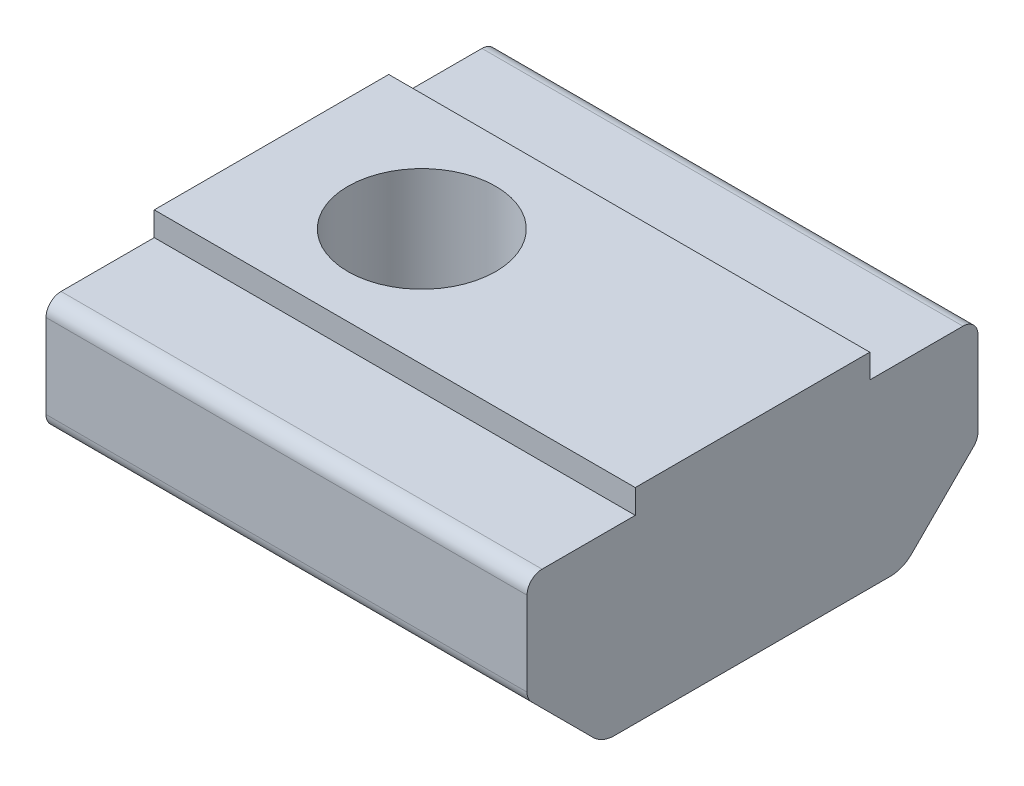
ISO-10303-21;
HEADER;
FILE_DESCRIPTION(('STEP AP214'),'2;1');
FILE_NAME('part.step','',(''),(''),'','','');
FILE_SCHEMA(('AUTOMOTIVE_DESIGN { 1 0 10303 214 1 1 1 1 }'));
ENDSEC;
DATA;
#1=APPLICATION_CONTEXT('core data for automotive mechanical design processes');
#2=APPLICATION_PROTOCOL_DEFINITION('international standard','automotive_design',2000,#1);
#3=PRODUCT_CONTEXT('',#1,'mechanical');
#4=PRODUCT('Part','Part','',(#3));
#5=PRODUCT_RELATED_PRODUCT_CATEGORY('part','',(#4));
#6=PRODUCT_DEFINITION_FORMATION('','',#4);
#7=PRODUCT_DEFINITION_CONTEXT('part definition',#1,'design');
#8=PRODUCT_DEFINITION('design','',#6,#7);
#9=PRODUCT_DEFINITION_SHAPE('','',#8);
#10=(LENGTH_UNIT() NAMED_UNIT(*) SI_UNIT(.MILLI.,.METRE.));
#11=(NAMED_UNIT(*) PLANE_ANGLE_UNIT() SI_UNIT($,.RADIAN.));
#12=(NAMED_UNIT(*) SI_UNIT($,.STERADIAN.) SOLID_ANGLE_UNIT());
#13=UNCERTAINTY_MEASURE_WITH_UNIT(LENGTH_MEASURE(1.E-05),#10,'distance_accuracy_value','');
#14=(GEOMETRIC_REPRESENTATION_CONTEXT(3) GLOBAL_UNCERTAINTY_ASSIGNED_CONTEXT((#13)) GLOBAL_UNIT_ASSIGNED_CONTEXT((#10,
#11,#12)) REPRESENTATION_CONTEXT('',''));
#15=CARTESIAN_POINT('',(0.,0.,0.));
#16=DIRECTION('',(0.,0.,1.));
#17=DIRECTION('',(1.,0.,0.));
#18=AXIS2_PLACEMENT_3D('',#15,#16,#17);
#19=CARTESIAN_POINT('',(7.,-6.6,0.));
#20=DIRECTION('',(0.,-1.,0.));
#21=DIRECTION('',(0.,0.,-1.));
#22=AXIS2_PLACEMENT_3D('',#19,#20,#21);
#23=PLANE('',#22);
#24=CARTESIAN_POINT('',(7.,-6.6,0.));
#25=DIRECTION('',(0.,1.,0.));
#26=DIRECTION('',(0.,0.,1.));
#27=AXIS2_PLACEMENT_3D('',#24,#25,#26);
#28=CIRCLE('',#27,2.35);
#29=CARTESIAN_POINT('',(7.,-6.6,2.35));
#30=VERTEX_POINT('',#29);
#31=EDGE_CURVE('E526',#30,#30,#28,.T.);
#32=ORIENTED_EDGE('',*,*,#31,.F.);
#33=EDGE_LOOP('',(#32));
#34=FACE_BOUND('',#33,.T.);
#35=CARTESIAN_POINT('',(7.,-6.6,0.));
#36=DIRECTION('',(0.,1.,0.));
#37=DIRECTION('',(0.,0.,1.));
#38=AXIS2_PLACEMENT_3D('',#35,#36,#37);
#39=CIRCLE('',#38,1.98997487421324);
#40=CARTESIAN_POINT('',(7.,-6.6,1.98997487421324));
#41=VERTEX_POINT('',#40);
#42=EDGE_CURVE('E528',#41,#41,#39,.T.);
#43=ORIENTED_EDGE('',*,*,#42,.T.);
#44=EDGE_LOOP('',(#43));
#45=FACE_BOUND('',#44,.T.);
#46=ADVANCED_FACE('F36',(#34,#45),#23,.T.);
#47=CARTESIAN_POINT('',(11.,-6.8,5.));
#48=DIRECTION('',(0.,1.,0.));
#49=DIRECTION('',(0.,0.,1.));
#50=AXIS2_PLACEMENT_3D('',#47,#48,#49);
#51=PLANE('',#50);
#52=CARTESIAN_POINT('',(0.,-6.8,0.));
#53=DIRECTION('',(0.,1.,0.));
#54=DIRECTION('',(0.,0.,1.));
#55=AXIS2_PLACEMENT_3D('',#52,#53,#54);
#56=CIRCLE('',#55,2.4585);
#57=CARTESIAN_POINT('',(0.,-6.8,2.4585));
#58=VERTEX_POINT('',#57);
#59=EDGE_CURVE('E533',#58,#58,#56,.T.);
#60=ORIENTED_EDGE('',*,*,#59,.T.);
#61=EDGE_LOOP('',(#60));
#62=FACE_BOUND('',#61,.T.);
#63=DIRECTION('',(0.,0.,-1.));
#64=VECTOR('',#63,1.);
#65=CARTESIAN_POINT('',(11.,-6.8,5.));
#66=LINE('',#65,#64);
#67=CARTESIAN_POINT('',(11.,-6.8,4.5857864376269));
#68=VERTEX_POINT('',#67);
#69=CARTESIAN_POINT('',(11.,-6.8,-4.58578643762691));
#70=VERTEX_POINT('',#69);
#71=EDGE_CURVE('E288',#68,#70,#66,.T.);
#72=ORIENTED_EDGE('',*,*,#71,.F.);
#73=DIRECTION('',(-1.,0.,0.));
#74=VECTOR('',#73,1.);
#75=CARTESIAN_POINT('',(11.,-6.8,4.5857864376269));
#76=LINE('',#75,#74);
#77=CARTESIAN_POINT('',(-5.,-6.8,4.5857864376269));
#78=VERTEX_POINT('',#77);
#79=EDGE_CURVE('E219',#68,#78,#76,.T.);
#80=ORIENTED_EDGE('',*,*,#79,.T.);
#81=DIRECTION('',(0.,0.,-1.));
#82=VECTOR('',#81,1.);
#83=CARTESIAN_POINT('',(-5.,-6.8,5.));
#84=LINE('',#83,#82);
#85=CARTESIAN_POINT('',(-5.,-6.8,-4.58578643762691));
#86=VERTEX_POINT('',#85);
#87=EDGE_CURVE('E192',#78,#86,#84,.T.);
#88=ORIENTED_EDGE('',*,*,#87,.T.);
#89=DIRECTION('',(-1.,0.,0.));
#90=VECTOR('',#89,1.);
#91=CARTESIAN_POINT('',(11.,-6.8,-4.58578643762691));
#92=LINE('',#91,#90);
#93=EDGE_CURVE('E171',#86,#70,#92,.F.);
#94=ORIENTED_EDGE('',*,*,#93,.T.);
#95=EDGE_LOOP('',(#72,#80,#88,#94));
#96=FACE_BOUND('',#95,.T.);
#97=CARTESIAN_POINT('',(7.,-6.8,0.));
#98=DIRECTION('',(0.,1.,0.));
#99=DIRECTION('',(0.,0.,1.));
#100=AXIS2_PLACEMENT_3D('',#97,#98,#99);
#101=CIRCLE('',#100,2.35);
#102=CARTESIAN_POINT('',(7.,-6.8,2.35));
#103=VERTEX_POINT('',#102);
#104=EDGE_CURVE('E190',#103,#103,#101,.T.);
#105=ORIENTED_EDGE('',*,*,#104,.T.);
#106=EDGE_LOOP('',(#105));
#107=FACE_BOUND('',#106,.T.);
#108=ADVANCED_FACE('F320',(#62,#96,#107),#51,.F.);
#109=CARTESIAN_POINT('',(11.,-0.8,7.5));
#110=DIRECTION('',(0.,0.,-1.));
#111=DIRECTION('',(-1.,0.,0.));
#112=AXIS2_PLACEMENT_3D('',#109,#110,#111);
#113=PLANE('',#112);
#114=DIRECTION('',(0.,-1.,0.));
#115=VECTOR('',#114,1.);
#116=CARTESIAN_POINT('',(11.,-0.8,7.5));
#117=LINE('',#116,#115);
#118=CARTESIAN_POINT('',(11.,-1.3,7.5));
#119=VERTEX_POINT('',#118);
#120=CARTESIAN_POINT('',(11.,-4.09289321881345,7.5));
#121=VERTEX_POINT('',#120);
#122=EDGE_CURVE('E211',#119,#121,#117,.T.);
#123=ORIENTED_EDGE('',*,*,#122,.F.);
#124=DIRECTION('',(-1.,0.,0.));
#125=VECTOR('',#124,1.);
#126=CARTESIAN_POINT('',(11.,-1.3,7.5));
#127=LINE('',#126,#125);
#128=CARTESIAN_POINT('',(-5.,-1.3,7.5));
#129=VERTEX_POINT('',#128);
#130=EDGE_CURVE('E261',#119,#129,#127,.T.);
#131=ORIENTED_EDGE('',*,*,#130,.T.);
#132=DIRECTION('',(0.,-1.,0.));
#133=VECTOR('',#132,1.);
#134=CARTESIAN_POINT('',(-5.,-0.8,7.5));
#135=LINE('',#134,#133);
#136=CARTESIAN_POINT('',(-5.,-4.09289321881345,7.5));
#137=VERTEX_POINT('',#136);
#138=EDGE_CURVE('E187',#129,#137,#135,.T.);
#139=ORIENTED_EDGE('',*,*,#138,.T.);
#140=DIRECTION('',(-1.,0.,0.));
#141=VECTOR('',#140,1.);
#142=CARTESIAN_POINT('',(11.,-4.09289321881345,7.5));
#143=LINE('',#142,#141);
#144=EDGE_CURVE('E51',#137,#121,#143,.F.);
#145=ORIENTED_EDGE('',*,*,#144,.T.);
#146=EDGE_LOOP('',(#123,#131,#139,#145));
#147=FACE_BOUND('',#146,.T.);
#148=ADVANCED_FACE('F274',(#147),#113,.F.);
#149=CARTESIAN_POINT('',(11.,-4.3,7.5));
#150=DIRECTION('',(0.,0.707106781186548,-0.707106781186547));
#151=DIRECTION('',(0.,0.707106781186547,0.707106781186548));
#152=AXIS2_PLACEMENT_3D('',#149,#150,#151);
#153=PLANE('',#152);
#154=DIRECTION('',(0.,-0.707106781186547,-0.707106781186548));
#155=VECTOR('',#154,1.);
#156=CARTESIAN_POINT('',(11.,-4.3,7.5));
#157=LINE('',#156,#155);
#158=CARTESIAN_POINT('',(11.,-4.44644660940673,7.35355339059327));
#159=VERTEX_POINT('',#158);
#160=CARTESIAN_POINT('',(11.,-6.50710678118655,5.29289321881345));
#161=VERTEX_POINT('',#160);
#162=EDGE_CURVE('E285',#159,#161,#157,.T.);
#163=ORIENTED_EDGE('',*,*,#162,.F.);
#164=DIRECTION('',(-1.,0.,0.));
#165=VECTOR('',#164,1.);
#166=CARTESIAN_POINT('',(11.,-4.44644660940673,7.35355339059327));
#167=LINE('',#166,#165);
#168=CARTESIAN_POINT('',(-5.,-4.44644660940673,7.35355339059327));
#169=VERTEX_POINT('',#168);
#170=EDGE_CURVE('E11',#159,#169,#167,.T.);
#171=ORIENTED_EDGE('',*,*,#170,.T.);
#172=DIRECTION('',(0.,-0.707106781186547,-0.707106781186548));
#173=VECTOR('',#172,1.);
#174=CARTESIAN_POINT('',(-5.,-4.3,7.5));
#175=LINE('',#174,#173);
#176=CARTESIAN_POINT('',(-5.,-6.50710678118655,5.29289321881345));
#177=VERTEX_POINT('',#176);
#178=EDGE_CURVE('E189',#169,#177,#175,.T.);
#179=ORIENTED_EDGE('',*,*,#178,.T.);
#180=DIRECTION('',(-1.,0.,0.));
#181=VECTOR('',#180,1.);
#182=CARTESIAN_POINT('',(11.,-6.50710678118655,5.29289321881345));
#183=LINE('',#182,#181);
#184=EDGE_CURVE('E227',#177,#161,#183,.F.);
#185=ORIENTED_EDGE('',*,*,#184,.T.);
#186=EDGE_LOOP('',(#163,#171,#179,#185));
#187=FACE_BOUND('',#186,.T.);
#188=ADVANCED_FACE('F284',(#187),#153,.F.);
#189=CARTESIAN_POINT('',(11.,-6.8,-5.));
#190=DIRECTION('',(0.,0.707106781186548,0.707106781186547));
#191=DIRECTION('',(0.,-0.707106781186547,0.707106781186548));
#192=AXIS2_PLACEMENT_3D('',#189,#190,#191);
#193=PLANE('',#192);
#194=DIRECTION('',(0.,0.707106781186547,-0.707106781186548));
#195=VECTOR('',#194,1.);
#196=CARTESIAN_POINT('',(-5.,-6.8,-5.));
#197=LINE('',#196,#195);
#198=CARTESIAN_POINT('',(-5.,-6.50710678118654,-5.29289321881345));
#199=VERTEX_POINT('',#198);
#200=CARTESIAN_POINT('',(-5.,-4.44644660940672,-7.35355339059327));
#201=VERTEX_POINT('',#200);
#202=EDGE_CURVE('E195',#199,#201,#197,.T.);
#203=ORIENTED_EDGE('',*,*,#202,.T.);
#204=DIRECTION('',(-1.,0.,0.));
#205=VECTOR('',#204,1.);
#206=CARTESIAN_POINT('',(11.,-4.44644660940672,-7.35355339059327));
#207=LINE('',#206,#205);
#208=CARTESIAN_POINT('',(11.,-4.44644660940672,-7.35355339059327));
#209=VERTEX_POINT('',#208);
#210=EDGE_CURVE('E250',#201,#209,#207,.F.);
#211=ORIENTED_EDGE('',*,*,#210,.T.);
#212=DIRECTION('',(0.,0.707106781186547,-0.707106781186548));
#213=VECTOR('',#212,1.);
#214=CARTESIAN_POINT('',(11.,-6.8,-5.));
#215=LINE('',#214,#213);
#216=CARTESIAN_POINT('',(11.,-6.50710678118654,-5.29289321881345));
#217=VERTEX_POINT('',#216);
#218=EDGE_CURVE('E291',#217,#209,#215,.T.);
#219=ORIENTED_EDGE('',*,*,#218,.F.);
#220=DIRECTION('',(-1.,0.,0.));
#221=VECTOR('',#220,1.);
#222=CARTESIAN_POINT('',(11.,-6.50710678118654,-5.29289321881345));
#223=LINE('',#222,#221);
#224=EDGE_CURVE('E234',#217,#199,#223,.T.);
#225=ORIENTED_EDGE('',*,*,#224,.T.);
#226=EDGE_LOOP('',(#203,#211,#219,#225));
#227=FACE_BOUND('',#226,.T.);
#228=ADVANCED_FACE('F428',(#227),#193,.F.);
#229=CARTESIAN_POINT('',(11.,-4.3,-7.5));
#230=DIRECTION('',(0.,0.,1.));
#231=DIRECTION('',(0.,-1.,0.));
#232=AXIS2_PLACEMENT_3D('',#229,#230,#231);
#233=PLANE('',#232);
#234=DIRECTION('',(0.,1.,0.));
#235=VECTOR('',#234,1.);
#236=CARTESIAN_POINT('',(11.,-4.3,-7.5));
#237=LINE('',#236,#235);
#238=CARTESIAN_POINT('',(11.,-4.09289321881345,-7.5));
#239=VERTEX_POINT('',#238);
#240=CARTESIAN_POINT('',(11.,-1.3,-7.5));
#241=VERTEX_POINT('',#240);
#242=EDGE_CURVE('E162',#239,#241,#237,.T.);
#243=ORIENTED_EDGE('',*,*,#242,.F.);
#244=DIRECTION('',(-1.,0.,0.));
#245=VECTOR('',#244,1.);
#246=CARTESIAN_POINT('',(11.,-4.09289321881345,-7.5));
#247=LINE('',#246,#245);
#248=CARTESIAN_POINT('',(-5.,-4.09289321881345,-7.5));
#249=VERTEX_POINT('',#248);
#250=EDGE_CURVE('E239',#239,#249,#247,.T.);
#251=ORIENTED_EDGE('',*,*,#250,.T.);
#252=DIRECTION('',(0.,1.,0.));
#253=VECTOR('',#252,1.);
#254=CARTESIAN_POINT('',(-5.,-4.3,-7.5));
#255=LINE('',#254,#253);
#256=CARTESIAN_POINT('',(-5.,-1.3,-7.5));
#257=VERTEX_POINT('',#256);
#258=EDGE_CURVE('E198',#249,#257,#255,.T.);
#259=ORIENTED_EDGE('',*,*,#258,.T.);
#260=DIRECTION('',(-1.,0.,0.));
#261=VECTOR('',#260,1.);
#262=CARTESIAN_POINT('',(11.,-1.3,-7.5));
#263=LINE('',#262,#261);
#264=EDGE_CURVE('E237',#257,#241,#263,.F.);
#265=ORIENTED_EDGE('',*,*,#264,.T.);
#266=EDGE_LOOP('',(#243,#251,#259,#265));
#267=FACE_BOUND('',#266,.T.);
#268=ADVANCED_FACE('F434',(#267),#233,.F.);
#269=CARTESIAN_POINT('',(11.,-0.799999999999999,-7.5));
#270=DIRECTION('',(0.,-1.,0.));
#271=DIRECTION('',(0.,0.,-1.));
#272=AXIS2_PLACEMENT_3D('',#269,#270,#271);
#273=PLANE('',#272);
#274=DIRECTION('',(0.,0.,1.));
#275=VECTOR('',#274,1.);
#276=CARTESIAN_POINT('',(11.,-0.799999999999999,-7.5));
#277=LINE('',#276,#275);
#278=CARTESIAN_POINT('',(11.,-0.799999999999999,-7.));
#279=VERTEX_POINT('',#278);
#280=CARTESIAN_POINT('',(11.,-0.799999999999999,-3.9));
#281=VERTEX_POINT('',#280);
#282=EDGE_CURVE('E149',#279,#281,#277,.T.);
#283=ORIENTED_EDGE('',*,*,#282,.F.);
#284=DIRECTION('',(-1.,0.,0.));
#285=VECTOR('',#284,1.);
#286=CARTESIAN_POINT('',(11.,-0.799999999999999,-7.));
#287=LINE('',#286,#285);
#288=CARTESIAN_POINT('',(-5.,-0.799999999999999,-7.));
#289=VERTEX_POINT('',#288);
#290=EDGE_CURVE('E258',#279,#289,#287,.T.);
#291=ORIENTED_EDGE('',*,*,#290,.T.);
#292=DIRECTION('',(0.,0.,1.));
#293=VECTOR('',#292,1.);
#294=CARTESIAN_POINT('',(-5.,-0.799999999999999,-7.5));
#295=LINE('',#294,#293);
#296=CARTESIAN_POINT('',(-5.,-0.799999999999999,-3.9));
#297=VERTEX_POINT('',#296);
#298=EDGE_CURVE('E168',#289,#297,#295,.T.);
#299=ORIENTED_EDGE('',*,*,#298,.T.);
#300=DIRECTION('',(-1.,0.,0.));
#301=VECTOR('',#300,1.);
#302=CARTESIAN_POINT('',(11.,-0.799999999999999,-3.9));
#303=LINE('',#302,#301);
#304=EDGE_CURVE('E165',#281,#297,#303,.T.);
#305=ORIENTED_EDGE('',*,*,#304,.F.);
#306=EDGE_LOOP('',(#283,#291,#299,#305));
#307=FACE_BOUND('',#306,.T.);
#308=ADVANCED_FACE('F166',(#307),#273,.F.);
#309=CARTESIAN_POINT('',(11.,-0.799999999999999,-3.9));
#310=DIRECTION('',(0.,0.,1.));
#311=DIRECTION('',(1.,0.,0.));
#312=AXIS2_PLACEMENT_3D('',#309,#310,#311);
#313=PLANE('',#312);
#314=DIRECTION('',(0.,1.,0.));
#315=VECTOR('',#314,1.);
#316=CARTESIAN_POINT('',(-5.,-0.799999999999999,-3.9));
#317=LINE('',#316,#315);
#318=CARTESIAN_POINT('',(-5.,0.,-3.9));
#319=VERTEX_POINT('',#318);
#320=EDGE_CURVE('E202',#297,#319,#317,.T.);
#321=ORIENTED_EDGE('',*,*,#320,.T.);
#322=DIRECTION('',(-1.,0.,0.));
#323=VECTOR('',#322,1.);
#324=CARTESIAN_POINT('',(11.,0.,-3.9));
#325=LINE('',#324,#323);
#326=CARTESIAN_POINT('',(11.,0.,-3.9));
#327=VERTEX_POINT('',#326);
#328=EDGE_CURVE('E172',#327,#319,#325,.T.);
#329=ORIENTED_EDGE('',*,*,#328,.F.);
#330=DIRECTION('',(0.,1.,0.));
#331=VECTOR('',#330,1.);
#332=CARTESIAN_POINT('',(11.,-0.799999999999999,-3.9));
#333=LINE('',#332,#331);
#334=EDGE_CURVE('E154',#281,#327,#333,.T.);
#335=ORIENTED_EDGE('',*,*,#334,.F.);
#336=ORIENTED_EDGE('',*,*,#304,.T.);
#337=EDGE_LOOP('',(#321,#329,#335,#336));
#338=FACE_BOUND('',#337,.T.);
#339=ADVANCED_FACE('F174',(#338),#313,.F.);
#340=CARTESIAN_POINT('',(11.,0.,-3.9));
#341=DIRECTION('',(0.,-1.,0.));
#342=DIRECTION('',(0.,0.,-1.));
#343=AXIS2_PLACEMENT_3D('',#340,#341,#342);
#344=PLANE('',#343);
#345=CARTESIAN_POINT('',(0.,0.,0.));
#346=DIRECTION('',(0.,1.,0.));
#347=DIRECTION('',(0.,0.,1.));
#348=AXIS2_PLACEMENT_3D('',#345,#346,#347);
#349=CIRCLE('',#348,2.4585);
#350=CARTESIAN_POINT('',(0.,0.,2.4585));
#351=VERTEX_POINT('',#350);
#352=EDGE_CURVE('E536',#351,#351,#349,.T.);
#353=ORIENTED_EDGE('',*,*,#352,.F.);
#354=EDGE_LOOP('',(#353));
#355=FACE_BOUND('',#354,.T.);
#356=DIRECTION('',(0.,0.,1.));
#357=VECTOR('',#356,1.);
#358=CARTESIAN_POINT('',(-5.,0.,-3.9));
#359=LINE('',#358,#357);
#360=CARTESIAN_POINT('',(-5.,0.,3.9));
#361=VERTEX_POINT('',#360);
#362=EDGE_CURVE('E204',#319,#361,#359,.T.);
#363=ORIENTED_EDGE('',*,*,#362,.T.);
#364=DIRECTION('',(-1.,0.,0.));
#365=VECTOR('',#364,1.);
#366=CARTESIAN_POINT('',(11.,0.,3.9));
#367=LINE('',#366,#365);
#368=CARTESIAN_POINT('',(11.,0.,3.9));
#369=VERTEX_POINT('',#368);
#370=EDGE_CURVE('E214',#369,#361,#367,.T.);
#371=ORIENTED_EDGE('',*,*,#370,.F.);
#372=DIRECTION('',(0.,0.,1.));
#373=VECTOR('',#372,1.);
#374=CARTESIAN_POINT('',(11.,0.,-3.9));
#375=LINE('',#374,#373);
#376=EDGE_CURVE('E177',#327,#369,#375,.T.);
#377=ORIENTED_EDGE('',*,*,#376,.F.);
#378=ORIENTED_EDGE('',*,*,#328,.T.);
#379=EDGE_LOOP('',(#363,#371,#377,#378));
#380=FACE_BOUND('',#379,.T.);
#381=ADVANCED_FACE('F306',(#355,#380),#344,.F.);
#382=CARTESIAN_POINT('',(11.,0.,3.9));
#383=DIRECTION('',(0.,0.,-1.));
#384=DIRECTION('',(0.,1.,0.));
#385=AXIS2_PLACEMENT_3D('',#382,#383,#384);
#386=PLANE('',#385);
#387=DIRECTION('',(0.,-1.,0.));
#388=VECTOR('',#387,1.);
#389=CARTESIAN_POINT('',(-5.,0.,3.9));
#390=LINE('',#389,#388);
#391=CARTESIAN_POINT('',(-5.,-0.8,3.9));
#392=VERTEX_POINT('',#391);
#393=EDGE_CURVE('E206',#361,#392,#390,.T.);
#394=ORIENTED_EDGE('',*,*,#393,.T.);
#395=DIRECTION('',(-1.,0.,0.));
#396=VECTOR('',#395,1.);
#397=CARTESIAN_POINT('',(11.,-0.8,3.9));
#398=LINE('',#397,#396);
#399=CARTESIAN_POINT('',(11.,-0.8,3.9));
#400=VERTEX_POINT('',#399);
#401=EDGE_CURVE('E186',#400,#392,#398,.T.);
#402=ORIENTED_EDGE('',*,*,#401,.F.);
#403=DIRECTION('',(0.,-1.,0.));
#404=VECTOR('',#403,1.);
#405=CARTESIAN_POINT('',(11.,0.,3.9));
#406=LINE('',#405,#404);
#407=EDGE_CURVE('E179',#369,#400,#406,.T.);
#408=ORIENTED_EDGE('',*,*,#407,.F.);
#409=ORIENTED_EDGE('',*,*,#370,.T.);
#410=EDGE_LOOP('',(#394,#402,#408,#409));
#411=FACE_BOUND('',#410,.T.);
#412=ADVANCED_FACE('F309',(#411),#386,.F.);
#413=CARTESIAN_POINT('',(11.,-0.8,3.9));
#414=DIRECTION('',(0.,-1.,0.));
#415=DIRECTION('',(0.,0.,-1.));
#416=AXIS2_PLACEMENT_3D('',#413,#414,#415);
#417=PLANE('',#416);
#418=DIRECTION('',(0.,0.,1.));
#419=VECTOR('',#418,1.);
#420=CARTESIAN_POINT('',(-5.,-0.8,3.9));
#421=LINE('',#420,#419);
#422=CARTESIAN_POINT('',(-5.,-0.8,7.));
#423=VERTEX_POINT('',#422);
#424=EDGE_CURVE('E208',#392,#423,#421,.T.);
#425=ORIENTED_EDGE('',*,*,#424,.T.);
#426=DIRECTION('',(-1.,0.,0.));
#427=VECTOR('',#426,1.);
#428=CARTESIAN_POINT('',(11.,-0.8,7.));
#429=LINE('',#428,#427);
#430=CARTESIAN_POINT('',(11.,-0.8,7.));
#431=VERTEX_POINT('',#430);
#432=EDGE_CURVE('E44',#423,#431,#429,.F.);
#433=ORIENTED_EDGE('',*,*,#432,.T.);
#434=DIRECTION('',(0.,0.,1.));
#435=VECTOR('',#434,1.);
#436=CARTESIAN_POINT('',(11.,-0.8,3.9));
#437=LINE('',#436,#435);
#438=EDGE_CURVE('E184',#400,#431,#437,.T.);
#439=ORIENTED_EDGE('',*,*,#438,.F.);
#440=ORIENTED_EDGE('',*,*,#401,.T.);
#441=EDGE_LOOP('',(#425,#433,#439,#440));
#442=FACE_BOUND('',#441,.T.);
#443=ADVANCED_FACE('F266',(#442),#417,.F.);
#444=CARTESIAN_POINT('',(11.,0.,0.));
#445=DIRECTION('',(1.,0.,0.));
#446=DIRECTION('',(0.,0.,-1.));
#447=AXIS2_PLACEMENT_3D('',#444,#445,#446);
#448=PLANE('',#447);
#449=ORIENTED_EDGE('',*,*,#218,.T.);
#450=CARTESIAN_POINT('',(11.,-4.09289321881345,-7.));
#451=DIRECTION('',(1.,0.,0.));
#452=DIRECTION('',(0.,0.,-1.));
#453=AXIS2_PLACEMENT_3D('',#450,#451,#452);
#454=CIRCLE('',#453,0.5);
#455=EDGE_CURVE('E256',#209,#239,#454,.T.);
#456=ORIENTED_EDGE('',*,*,#455,.T.);
#457=ORIENTED_EDGE('',*,*,#242,.T.);
#458=CARTESIAN_POINT('',(11.,-1.3,-7.));
#459=DIRECTION('',(1.,0.,0.));
#460=DIRECTION('',(0.,0.,-1.));
#461=AXIS2_PLACEMENT_3D('',#458,#459,#460);
#462=CIRCLE('',#461,0.5);
#463=EDGE_CURVE('E158',#241,#279,#462,.T.);
#464=ORIENTED_EDGE('',*,*,#463,.T.);
#465=ORIENTED_EDGE('',*,*,#282,.T.);
#466=ORIENTED_EDGE('',*,*,#334,.T.);
#467=ORIENTED_EDGE('',*,*,#376,.T.);
#468=ORIENTED_EDGE('',*,*,#407,.T.);
#469=ORIENTED_EDGE('',*,*,#438,.T.);
#470=CARTESIAN_POINT('',(11.,-1.3,7.));
#471=DIRECTION('',(1.,0.,0.));
#472=DIRECTION('',(0.,0.,-1.));
#473=AXIS2_PLACEMENT_3D('',#470,#471,#472);
#474=CIRCLE('',#473,0.5);
#475=EDGE_CURVE('E58',#431,#119,#474,.T.);
#476=ORIENTED_EDGE('',*,*,#475,.T.);
#477=ORIENTED_EDGE('',*,*,#122,.T.);
#478=CARTESIAN_POINT('',(11.,-4.09289321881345,7.));
#479=DIRECTION('',(1.,0.,0.));
#480=DIRECTION('',(0.,0.,-1.));
#481=AXIS2_PLACEMENT_3D('',#478,#479,#480);
#482=CIRCLE('',#481,0.5);
#483=EDGE_CURVE('E252',#121,#159,#482,.T.);
#484=ORIENTED_EDGE('',*,*,#483,.T.);
#485=ORIENTED_EDGE('',*,*,#162,.T.);
#486=CARTESIAN_POINT('',(11.,-5.8,4.5857864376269));
#487=DIRECTION('',(1.,0.,0.));
#488=DIRECTION('',(0.,0.,-1.));
#489=AXIS2_PLACEMENT_3D('',#486,#487,#488);
#490=CIRCLE('',#489,1.);
#491=EDGE_CURVE('E232',#161,#68,#490,.T.);
#492=ORIENTED_EDGE('',*,*,#491,.T.);
#493=ORIENTED_EDGE('',*,*,#71,.T.);
#494=CARTESIAN_POINT('',(11.,-5.8,-4.58578643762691));
#495=DIRECTION('',(1.,0.,0.));
#496=DIRECTION('',(0.,0.,-1.));
#497=AXIS2_PLACEMENT_3D('',#494,#495,#496);
#498=CIRCLE('',#497,1.);
#499=EDGE_CURVE('E230',#70,#217,#498,.T.);
#500=ORIENTED_EDGE('',*,*,#499,.T.);
#501=EDGE_LOOP('',(#449,#456,#457,#464,#465,#466,#467,#468,#469,#476,#477,#484,#485,#492,#493,#500));
#502=FACE_BOUND('',#501,.T.);
#503=ADVANCED_FACE('F152',(#502),#448,.T.);
#504=CARTESIAN_POINT('',(-5.,0.,0.));
#505=DIRECTION('',(1.,0.,0.));
#506=DIRECTION('',(0.,0.,-1.));
#507=AXIS2_PLACEMENT_3D('',#504,#505,#506);
#508=PLANE('',#507);
#509=ORIENTED_EDGE('',*,*,#258,.F.);
#510=CARTESIAN_POINT('',(-5.,-4.09289321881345,-7.));
#511=DIRECTION('',(1.,0.,0.));
#512=DIRECTION('',(0.,0.,-1.));
#513=AXIS2_PLACEMENT_3D('',#510,#511,#512);
#514=CIRCLE('',#513,0.5);
#515=EDGE_CURVE('E248',#249,#201,#514,.F.);
#516=ORIENTED_EDGE('',*,*,#515,.T.);
#517=ORIENTED_EDGE('',*,*,#202,.F.);
#518=CARTESIAN_POINT('',(-5.,-5.8,-4.58578643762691));
#519=DIRECTION('',(1.,0.,0.));
#520=DIRECTION('',(0.,0.,-1.));
#521=AXIS2_PLACEMENT_3D('',#518,#519,#520);
#522=CIRCLE('',#521,1.);
#523=EDGE_CURVE('E222',#199,#86,#522,.F.);
#524=ORIENTED_EDGE('',*,*,#523,.T.);
#525=ORIENTED_EDGE('',*,*,#87,.F.);
#526=CARTESIAN_POINT('',(-5.,-5.8,4.5857864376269));
#527=DIRECTION('',(1.,0.,0.));
#528=DIRECTION('',(0.,0.,-1.));
#529=AXIS2_PLACEMENT_3D('',#526,#527,#528);
#530=CIRCLE('',#529,1.);
#531=EDGE_CURVE('E224',#78,#177,#530,.F.);
#532=ORIENTED_EDGE('',*,*,#531,.T.);
#533=ORIENTED_EDGE('',*,*,#178,.F.);
#534=CARTESIAN_POINT('',(-5.,-4.09289321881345,7.));
#535=DIRECTION('',(1.,0.,0.));
#536=DIRECTION('',(0.,0.,-1.));
#537=AXIS2_PLACEMENT_3D('',#534,#535,#536);
#538=CIRCLE('',#537,0.5);
#539=EDGE_CURVE('E242',#169,#137,#538,.F.);
#540=ORIENTED_EDGE('',*,*,#539,.T.);
#541=ORIENTED_EDGE('',*,*,#138,.F.);
#542=CARTESIAN_POINT('',(-5.,-1.3,7.));
#543=DIRECTION('',(1.,0.,0.));
#544=DIRECTION('',(0.,0.,-1.));
#545=AXIS2_PLACEMENT_3D('',#542,#543,#544);
#546=CIRCLE('',#545,0.5);
#547=EDGE_CURVE('E244',#129,#423,#546,.F.);
#548=ORIENTED_EDGE('',*,*,#547,.T.);
#549=ORIENTED_EDGE('',*,*,#424,.F.);
#550=ORIENTED_EDGE('',*,*,#393,.F.);
#551=ORIENTED_EDGE('',*,*,#362,.F.);
#552=ORIENTED_EDGE('',*,*,#320,.F.);
#553=ORIENTED_EDGE('',*,*,#298,.F.);
#554=CARTESIAN_POINT('',(-5.,-1.3,-7.));
#555=DIRECTION('',(1.,0.,0.));
#556=DIRECTION('',(0.,0.,-1.));
#557=AXIS2_PLACEMENT_3D('',#554,#555,#556);
#558=CIRCLE('',#557,0.5);
#559=EDGE_CURVE('E246',#289,#257,#558,.F.);
#560=ORIENTED_EDGE('',*,*,#559,.T.);
#561=EDGE_LOOP('',(#509,#516,#517,#524,#525,#532,#533,#540,#541,#548,#549,#550,#551,#552,#553,#560));
#562=FACE_BOUND('',#561,.T.);
#563=ADVANCED_FACE('F277',(#562),#508,.F.);
#564=CARTESIAN_POINT('',(11.,-5.8,4.5857864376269));
#565=DIRECTION('',(-1.,0.,0.));
#566=DIRECTION('',(0.,0.,1.));
#567=AXIS2_PLACEMENT_3D('',#564,#565,#566);
#568=CYLINDRICAL_SURFACE('',#567,1.);
#569=ORIENTED_EDGE('',*,*,#491,.F.);
#570=ORIENTED_EDGE('',*,*,#184,.F.);
#571=ORIENTED_EDGE('',*,*,#531,.F.);
#572=ORIENTED_EDGE('',*,*,#79,.F.);
#573=EDGE_LOOP('',(#569,#570,#571,#572));
#574=FACE_BOUND('',#573,.T.);
#575=ADVANCED_FACE('F341',(#574),#568,.T.);
#576=CARTESIAN_POINT('',(11.,-5.8,-4.58578643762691));
#577=DIRECTION('',(-1.,0.,0.));
#578=DIRECTION('',(0.,0.,1.));
#579=AXIS2_PLACEMENT_3D('',#576,#577,#578);
#580=CYLINDRICAL_SURFACE('',#579,1.);
#581=ORIENTED_EDGE('',*,*,#499,.F.);
#582=ORIENTED_EDGE('',*,*,#93,.F.);
#583=ORIENTED_EDGE('',*,*,#523,.F.);
#584=ORIENTED_EDGE('',*,*,#224,.F.);
#585=EDGE_LOOP('',(#581,#582,#583,#584));
#586=FACE_BOUND('',#585,.T.);
#587=ADVANCED_FACE('F345',(#586),#580,.T.);
#588=CARTESIAN_POINT('',(11.,-4.09289321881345,-7.));
#589=DIRECTION('',(-1.,0.,0.));
#590=DIRECTION('',(0.,0.,1.));
#591=AXIS2_PLACEMENT_3D('',#588,#589,#590);
#592=CYLINDRICAL_SURFACE('',#591,0.5);
#593=ORIENTED_EDGE('',*,*,#455,.F.);
#594=ORIENTED_EDGE('',*,*,#210,.F.);
#595=ORIENTED_EDGE('',*,*,#515,.F.);
#596=ORIENTED_EDGE('',*,*,#250,.F.);
#597=EDGE_LOOP('',(#593,#594,#595,#596));
#598=FACE_BOUND('',#597,.T.);
#599=ADVANCED_FACE('F351',(#598),#592,.T.);
#600=CARTESIAN_POINT('',(11.,-1.3,-7.));
#601=DIRECTION('',(-1.,0.,0.));
#602=DIRECTION('',(0.,0.,1.));
#603=AXIS2_PLACEMENT_3D('',#600,#601,#602);
#604=CYLINDRICAL_SURFACE('',#603,0.5);
#605=ORIENTED_EDGE('',*,*,#463,.F.);
#606=ORIENTED_EDGE('',*,*,#264,.F.);
#607=ORIENTED_EDGE('',*,*,#559,.F.);
#608=ORIENTED_EDGE('',*,*,#290,.F.);
#609=EDGE_LOOP('',(#605,#606,#607,#608));
#610=FACE_BOUND('',#609,.T.);
#611=ADVANCED_FACE('F302',(#610),#604,.T.);
#612=CARTESIAN_POINT('',(11.,-1.3,7.));
#613=DIRECTION('',(-1.,0.,0.));
#614=DIRECTION('',(0.,0.,1.));
#615=AXIS2_PLACEMENT_3D('',#612,#613,#614);
#616=CYLINDRICAL_SURFACE('',#615,0.5);
#617=ORIENTED_EDGE('',*,*,#475,.F.);
#618=ORIENTED_EDGE('',*,*,#432,.F.);
#619=ORIENTED_EDGE('',*,*,#547,.F.);
#620=ORIENTED_EDGE('',*,*,#130,.F.);
#621=EDGE_LOOP('',(#617,#618,#619,#620));
#622=FACE_BOUND('',#621,.T.);
#623=ADVANCED_FACE('F272',(#622),#616,.T.);
#624=CARTESIAN_POINT('',(11.,-4.09289321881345,7.));
#625=DIRECTION('',(-1.,0.,0.));
#626=DIRECTION('',(0.,0.,1.));
#627=AXIS2_PLACEMENT_3D('',#624,#625,#626);
#628=CYLINDRICAL_SURFACE('',#627,0.5);
#629=ORIENTED_EDGE('',*,*,#483,.F.);
#630=ORIENTED_EDGE('',*,*,#144,.F.);
#631=ORIENTED_EDGE('',*,*,#539,.F.);
#632=ORIENTED_EDGE('',*,*,#170,.F.);
#633=EDGE_LOOP('',(#629,#630,#631,#632));
#634=FACE_BOUND('',#633,.T.);
#635=ADVANCED_FACE('F38',(#634),#628,.T.);
#636=CARTESIAN_POINT('',(7.,1.66554857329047,0.));
#637=DIRECTION('',(0.,1.,0.));
#638=DIRECTION('',(0.,0.,1.));
#639=AXIS2_PLACEMENT_3D('',#636,#637,#638);
#640=CYLINDRICAL_SURFACE('',#639,2.35);
#641=ORIENTED_EDGE('',*,*,#31,.T.);
#642=EDGE_LOOP('',(#641));
#643=FACE_BOUND('',#642,.T.);
#644=ORIENTED_EDGE('',*,*,#104,.F.);
#645=EDGE_LOOP('',(#644));
#646=FACE_BOUND('',#645,.T.);
#647=ADVANCED_FACE('F334',(#643,#646),#640,.F.);
#648=CARTESIAN_POINT('',(7.,-5.55,0.));
#649=DIRECTION('',(0.,1.,0.));
#650=DIRECTION('',(0.,0.,1.));
#651=AXIS2_PLACEMENT_3D('',#648,#649,#650);
#652=SPHERICAL_SURFACE('',#651,2.25);
#653=ORIENTED_EDGE('',*,*,#42,.F.);
#654=EDGE_LOOP('',(#653));
#655=FACE_BOUND('',#654,.T.);
#656=ADVANCED_FACE('F332',(#655),#652,.T.);
#657=CARTESIAN_POINT('',(0.,0.,0.));
#658=DIRECTION('',(0.,1.,0.));
#659=DIRECTION('',(0.,0.,1.));
#660=AXIS2_PLACEMENT_3D('',#657,#658,#659);
#661=CYLINDRICAL_SURFACE('',#660,2.4585);
#662=ORIENTED_EDGE('',*,*,#352,.T.);
#663=EDGE_LOOP('',(#662));
#664=FACE_BOUND('',#663,.T.);
#665=ORIENTED_EDGE('',*,*,#59,.F.);
#666=EDGE_LOOP('',(#665));
#667=FACE_BOUND('',#666,.T.);
#668=ADVANCED_FACE('F377',(#664,#667),#661,.F.);
#669=CLOSED_SHELL('',(#46,#108,#148,#188,#228,#268,#308,#339,#381,#412,#443,#503,#563,#575,#587,
#599,#611,#623,#635,#647,#656,#668));
#670=MANIFOLD_SOLID_BREP('B2',#669);
#671=ADVANCED_BREP_SHAPE_REPRESENTATION('',(#18,#670),#14);
#672=SHAPE_DEFINITION_REPRESENTATION(#9,#671);
ENDSEC;
END-ISO-10303-21;
